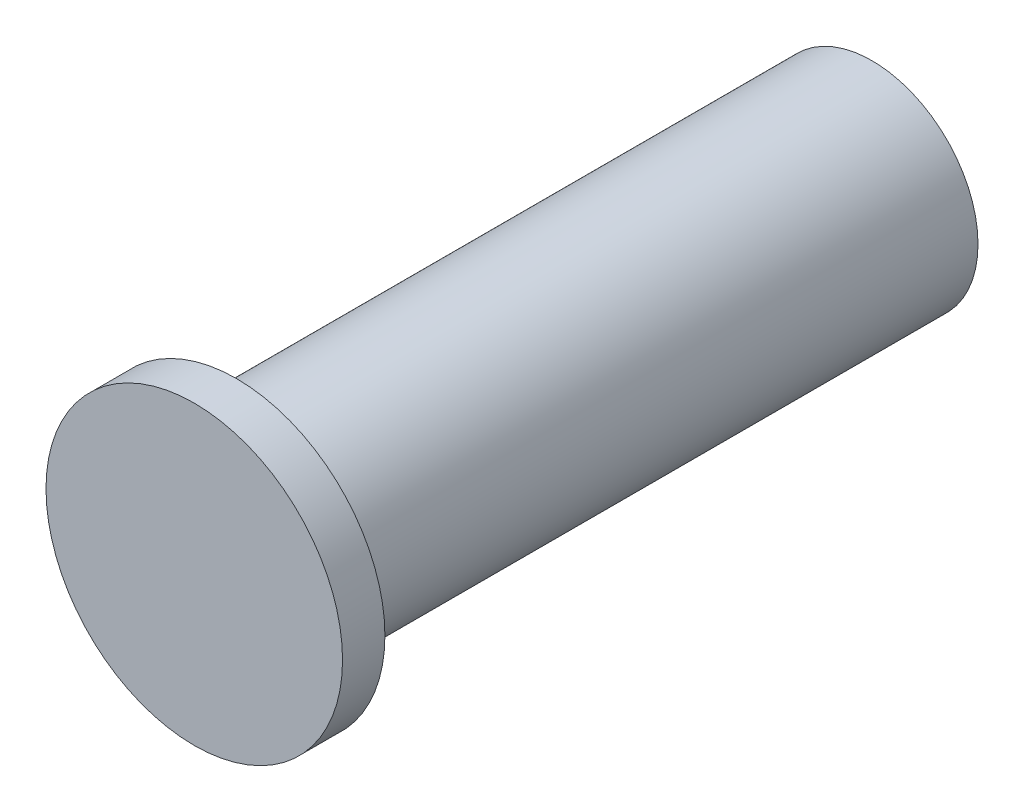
from build123d import *

# Parameters (mm, degrees)
SKETCH1_R           = 1.27
BOSS_EXTRUDE1_DEPTH = 7.62
SKETCH2_R           = 1.778
BOSS_EXTRUDE2_DEPTH = 0.508


with BuildPart() as part:
    # Sketch1 → Boss-Extrude1 (new body)
    with BuildSketch(Plane.XY):
        Circle(SKETCH1_R)
    extrude(amount=-BOSS_EXTRUDE1_DEPTH)

    # Sketch2 → Boss-Extrude2 (add)
    with BuildSketch(Plane.XY):
        Circle(SKETCH2_R)
    extrude(amount=BOSS_EXTRUDE2_DEPTH)


solid = part.part
